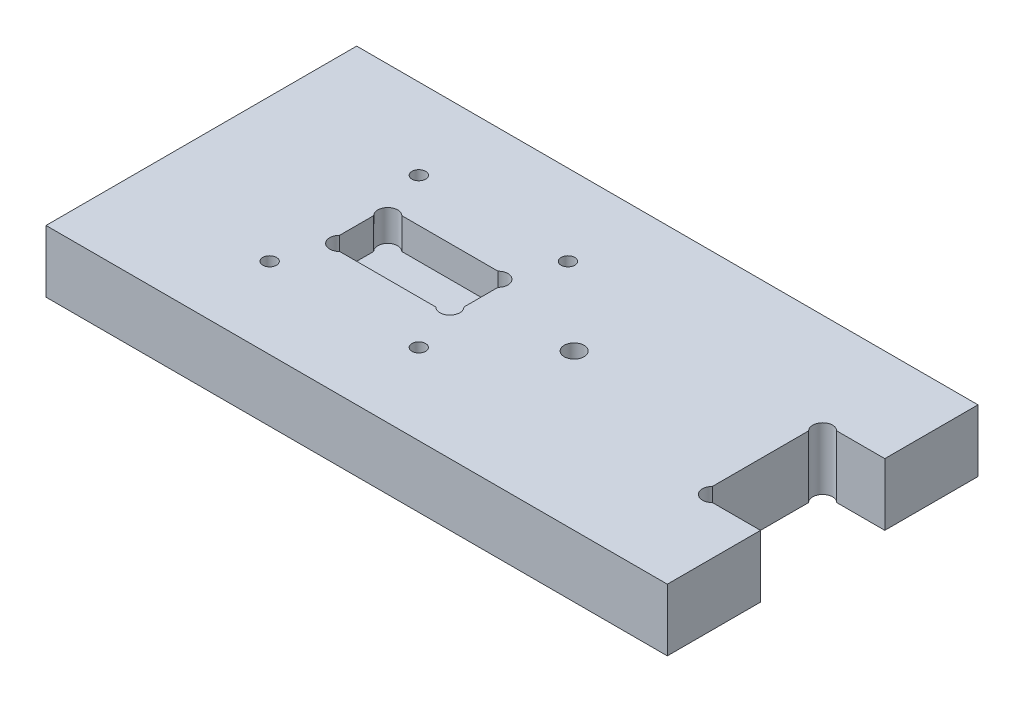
ISO-10303-21;
HEADER;
FILE_DESCRIPTION(('STEP AP214'),'2;1');
FILE_NAME('part.step','',(''),(''),'','','');
FILE_SCHEMA(('AUTOMOTIVE_DESIGN { 1 0 10303 214 1 1 1 1 }'));
ENDSEC;
DATA;
#1=APPLICATION_CONTEXT('core data for automotive mechanical design processes');
#2=APPLICATION_PROTOCOL_DEFINITION('international standard','automotive_design',2000,#1);
#3=PRODUCT_CONTEXT('',#1,'mechanical');
#4=PRODUCT('Part','Part','',(#3));
#5=PRODUCT_RELATED_PRODUCT_CATEGORY('part','',(#4));
#6=PRODUCT_DEFINITION_FORMATION('','',#4);
#7=PRODUCT_DEFINITION_CONTEXT('part definition',#1,'design');
#8=PRODUCT_DEFINITION('design','',#6,#7);
#9=PRODUCT_DEFINITION_SHAPE('','',#8);
#10=(LENGTH_UNIT() NAMED_UNIT(*) SI_UNIT(.MILLI.,.METRE.));
#11=(NAMED_UNIT(*) PLANE_ANGLE_UNIT() SI_UNIT($,.RADIAN.));
#12=(NAMED_UNIT(*) SI_UNIT($,.STERADIAN.) SOLID_ANGLE_UNIT());
#13=UNCERTAINTY_MEASURE_WITH_UNIT(LENGTH_MEASURE(1.E-05),#10,'distance_accuracy_value','');
#14=(GEOMETRIC_REPRESENTATION_CONTEXT(3) GLOBAL_UNCERTAINTY_ASSIGNED_CONTEXT((#13)) GLOBAL_UNIT_ASSIGNED_CONTEXT((#10,
#11,#12)) REPRESENTATION_CONTEXT('',''));
#15=CARTESIAN_POINT('',(0.,0.,0.));
#16=DIRECTION('',(0.,0.,1.));
#17=DIRECTION('',(1.,0.,0.));
#18=AXIS2_PLACEMENT_3D('',#15,#16,#17);
#19=CARTESIAN_POINT('',(91.1313708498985,10.,-33.8686291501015));
#20=DIRECTION('',(0.,-1.,0.));
#21=DIRECTION('',(0.,0.,-1.));
#22=AXIS2_PLACEMENT_3D('',#19,#20,#21);
#23=PLANE('',#22);
#24=DIRECTION('',(0.,0.,1.));
#25=VECTOR('',#24,1.);
#26=CARTESIAN_POINT('',(25.,10.,-27.737258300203));
#27=LINE('',#26,#25);
#28=CARTESIAN_POINT('',(25.,10.,-27.737258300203));
#29=VERTEX_POINT('',#28);
#30=CARTESIAN_POINT('',(25.,10.,-22.262741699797));
#31=VERTEX_POINT('',#30);
#32=EDGE_CURVE('E292',#29,#31,#27,.T.);
#33=ORIENTED_EDGE('',*,*,#32,.F.);
#34=CARTESIAN_POINT('',(26.1313708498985,10.,-28.8686291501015));
#35=DIRECTION('',(0.,1.,0.));
#36=DIRECTION('',(0.,0.,1.));
#37=AXIS2_PLACEMENT_3D('',#34,#35,#36);
#38=CIRCLE('',#37,1.6);
#39=CARTESIAN_POINT('',(27.262741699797,10.,-30.));
#40=VERTEX_POINT('',#39);
#41=EDGE_CURVE('E47',#40,#29,#38,.T.);
#42=ORIENTED_EDGE('',*,*,#41,.F.);
#43=DIRECTION('',(-1.,0.,0.));
#44=VECTOR('',#43,1.);
#45=CARTESIAN_POINT('',(27.262741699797,10.,-30.));
#46=LINE('',#45,#44);
#47=CARTESIAN_POINT('',(42.7372583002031,10.,-30.));
#48=VERTEX_POINT('',#47);
#49=EDGE_CURVE('E273',#48,#40,#46,.T.);
#50=ORIENTED_EDGE('',*,*,#49,.F.);
#51=CARTESIAN_POINT('',(43.8686291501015,10.,-28.8686291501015));
#52=DIRECTION('',(0.,1.,0.));
#53=DIRECTION('',(0.,0.,-1.));
#54=AXIS2_PLACEMENT_3D('',#51,#52,#53);
#55=CIRCLE('',#54,1.6);
#56=CARTESIAN_POINT('',(45.,10.,-27.737258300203));
#57=VERTEX_POINT('',#56);
#58=EDGE_CURVE('E277',#57,#48,#55,.T.);
#59=ORIENTED_EDGE('',*,*,#58,.F.);
#60=DIRECTION('',(0.,0.,-1.));
#61=VECTOR('',#60,1.);
#62=CARTESIAN_POINT('',(45.,10.,-27.737258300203));
#63=LINE('',#62,#61);
#64=CARTESIAN_POINT('',(45.,10.,-22.262741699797));
#65=VERTEX_POINT('',#64);
#66=EDGE_CURVE('E280',#65,#57,#63,.T.);
#67=ORIENTED_EDGE('',*,*,#66,.F.);
#68=CARTESIAN_POINT('',(43.8686291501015,10.,-21.1313708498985));
#69=DIRECTION('',(0.,1.,0.));
#70=DIRECTION('',(0.,0.,1.));
#71=AXIS2_PLACEMENT_3D('',#68,#69,#70);
#72=CIRCLE('',#71,1.6);
#73=CARTESIAN_POINT('',(42.7372583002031,10.,-20.));
#74=VERTEX_POINT('',#73);
#75=EDGE_CURVE('E283',#74,#65,#72,.T.);
#76=ORIENTED_EDGE('',*,*,#75,.F.);
#77=DIRECTION('',(1.,0.,0.));
#78=VECTOR('',#77,1.);
#79=CARTESIAN_POINT('',(27.262741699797,10.,-20.));
#80=LINE('',#79,#78);
#81=CARTESIAN_POINT('',(27.262741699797,10.,-20.));
#82=VERTEX_POINT('',#81);
#83=EDGE_CURVE('E286',#82,#74,#80,.T.);
#84=ORIENTED_EDGE('',*,*,#83,.F.);
#85=CARTESIAN_POINT('',(26.1313708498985,10.,-21.1313708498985));
#86=DIRECTION('',(0.,1.,0.));
#87=DIRECTION('',(0.,0.,-1.));
#88=AXIS2_PLACEMENT_3D('',#85,#86,#87);
#89=CIRCLE('',#88,1.6);
#90=EDGE_CURVE('E289',#31,#82,#89,.T.);
#91=ORIENTED_EDGE('',*,*,#90,.F.);
#92=EDGE_LOOP('',(#33,#42,#50,#59,#67,#76,#84,#91));
#93=FACE_BOUND('',#92,.T.);
#94=CARTESIAN_POINT('',(23.,10.,-37.));
#95=DIRECTION('',(0.,1.,0.));
#96=DIRECTION('',(0.,0.,-1.));
#97=AXIS2_PLACEMENT_3D('',#94,#95,#96);
#98=CIRCLE('',#97,1.1);
#99=CARTESIAN_POINT('',(23.,10.,-38.1));
#100=VERTEX_POINT('',#99);
#101=EDGE_CURVE('E236',#100,#100,#98,.T.);
#102=ORIENTED_EDGE('',*,*,#101,.F.);
#103=EDGE_LOOP('',(#102));
#104=FACE_BOUND('',#103,.T.);
#105=CARTESIAN_POINT('',(47.,10.,-13.));
#106=DIRECTION('',(0.,1.,0.));
#107=DIRECTION('',(0.,0.,-1.));
#108=AXIS2_PLACEMENT_3D('',#105,#106,#107);
#109=CIRCLE('',#108,1.1);
#110=CARTESIAN_POINT('',(47.,10.,-14.1));
#111=VERTEX_POINT('',#110);
#112=EDGE_CURVE('E224',#111,#111,#109,.T.);
#113=ORIENTED_EDGE('',*,*,#112,.F.);
#114=EDGE_LOOP('',(#113));
#115=FACE_BOUND('',#114,.T.);
#116=DIRECTION('',(-1.,0.,0.));
#117=VECTOR('',#116,1.);
#118=CARTESIAN_POINT('',(0.,10.,-50.));
#119=LINE('',#118,#117);
#120=CARTESIAN_POINT('',(100.,10.,-50.));
#121=VERTEX_POINT('',#120);
#122=CARTESIAN_POINT('',(0.,10.,-50.));
#123=VERTEX_POINT('',#122);
#124=EDGE_CURVE('E173',#121,#123,#119,.T.);
#125=ORIENTED_EDGE('',*,*,#124,.T.);
#126=DIRECTION('',(0.,0.,1.));
#127=VECTOR('',#126,1.);
#128=CARTESIAN_POINT('',(0.,10.,-50.));
#129=LINE('',#128,#127);
#130=CARTESIAN_POINT('',(0.,10.,0.));
#131=VERTEX_POINT('',#130);
#132=EDGE_CURVE('E103',#123,#131,#129,.T.);
#133=ORIENTED_EDGE('',*,*,#132,.T.);
#134=DIRECTION('',(1.,0.,0.));
#135=VECTOR('',#134,1.);
#136=CARTESIAN_POINT('',(0.,10.,0.));
#137=LINE('',#136,#135);
#138=CARTESIAN_POINT('',(100.,10.,0.));
#139=VERTEX_POINT('',#138);
#140=EDGE_CURVE('E194',#131,#139,#137,.T.);
#141=ORIENTED_EDGE('',*,*,#140,.T.);
#142=DIRECTION('',(0.,0.,-1.));
#143=VECTOR('',#142,1.);
#144=CARTESIAN_POINT('',(100.,10.,-15.));
#145=LINE('',#144,#143);
#146=CARTESIAN_POINT('',(100.,10.,-15.));
#147=VERTEX_POINT('',#146);
#148=EDGE_CURVE('E213',#139,#147,#145,.T.);
#149=ORIENTED_EDGE('',*,*,#148,.T.);
#150=DIRECTION('',(-1.,0.,0.));
#151=VECTOR('',#150,1.);
#152=CARTESIAN_POINT('',(92.262741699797,10.,-15.));
#153=LINE('',#152,#151);
#154=CARTESIAN_POINT('',(92.262741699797,10.,-15.));
#155=VERTEX_POINT('',#154);
#156=EDGE_CURVE('E210',#147,#155,#153,.T.);
#157=ORIENTED_EDGE('',*,*,#156,.T.);
#158=CARTESIAN_POINT('',(91.1313708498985,10.,-16.1313708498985));
#159=DIRECTION('',(0.,-1.,0.));
#160=DIRECTION('',(0.,0.,1.));
#161=AXIS2_PLACEMENT_3D('',#158,#159,#160);
#162=CIRCLE('',#161,1.60000000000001);
#163=CARTESIAN_POINT('',(90.,10.,-17.2627416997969));
#164=VERTEX_POINT('',#163);
#165=EDGE_CURVE('E212',#155,#164,#162,.T.);
#166=ORIENTED_EDGE('',*,*,#165,.T.);
#167=DIRECTION('',(0.,0.,-1.));
#168=VECTOR('',#167,1.);
#169=CARTESIAN_POINT('',(90.,10.,-32.7372583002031));
#170=LINE('',#169,#168);
#171=CARTESIAN_POINT('',(90.,10.,-32.7372583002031));
#172=VERTEX_POINT('',#171);
#173=EDGE_CURVE('E132',#164,#172,#170,.T.);
#174=ORIENTED_EDGE('',*,*,#173,.T.);
#175=CARTESIAN_POINT('',(91.1313708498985,10.,-33.8686291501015));
#176=DIRECTION('',(0.,-1.,0.));
#177=DIRECTION('',(0.,0.,-1.));
#178=AXIS2_PLACEMENT_3D('',#175,#176,#177);
#179=CIRCLE('',#178,1.60000000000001);
#180=CARTESIAN_POINT('',(92.262741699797,10.,-35.));
#181=VERTEX_POINT('',#180);
#182=EDGE_CURVE('E125',#172,#181,#179,.T.);
#183=ORIENTED_EDGE('',*,*,#182,.T.);
#184=DIRECTION('',(1.,0.,0.));
#185=VECTOR('',#184,1.);
#186=CARTESIAN_POINT('',(92.262741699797,10.,-35.));
#187=LINE('',#186,#185);
#188=CARTESIAN_POINT('',(100.,10.,-35.));
#189=VERTEX_POINT('',#188);
#190=EDGE_CURVE('E129',#181,#189,#187,.T.);
#191=ORIENTED_EDGE('',*,*,#190,.T.);
#192=DIRECTION('',(0.,0.,-1.));
#193=VECTOR('',#192,1.);
#194=CARTESIAN_POINT('',(100.,10.,-35.));
#195=LINE('',#194,#193);
#196=EDGE_CURVE('E56',#189,#121,#195,.T.);
#197=ORIENTED_EDGE('',*,*,#196,.T.);
#198=EDGE_LOOP('',(#125,#133,#141,#149,#157,#166,#174,#183,#191,#197));
#199=FACE_BOUND('',#198,.T.);
#200=CARTESIAN_POINT('',(23.,10.,-13.));
#201=DIRECTION('',(0.,1.,0.));
#202=DIRECTION('',(0.,0.,1.));
#203=AXIS2_PLACEMENT_3D('',#200,#201,#202);
#204=CIRCLE('',#203,1.1);
#205=CARTESIAN_POINT('',(23.,10.,-11.9));
#206=VERTEX_POINT('',#205);
#207=EDGE_CURVE('E157',#206,#206,#204,.T.);
#208=ORIENTED_EDGE('',*,*,#207,.F.);
#209=EDGE_LOOP('',(#208));
#210=FACE_BOUND('',#209,.T.);
#211=CARTESIAN_POINT('',(47.,10.,-37.));
#212=DIRECTION('',(0.,1.,0.));
#213=DIRECTION('',(0.,0.,1.));
#214=AXIS2_PLACEMENT_3D('',#211,#212,#213);
#215=CIRCLE('',#214,1.1);
#216=CARTESIAN_POINT('',(47.,10.,-35.9));
#217=VERTEX_POINT('',#216);
#218=EDGE_CURVE('E230',#217,#217,#215,.T.);
#219=ORIENTED_EDGE('',*,*,#218,.F.);
#220=EDGE_LOOP('',(#219));
#221=FACE_BOUND('',#220,.T.);
#222=CARTESIAN_POINT('',(60.0000000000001,10.,-25.));
#223=DIRECTION('',(0.,1.,0.));
#224=DIRECTION('',(0.,0.,1.));
#225=AXIS2_PLACEMENT_3D('',#222,#223,#224);
#226=CIRCLE('',#225,1.6);
#227=CARTESIAN_POINT('',(60.0000000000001,10.,-23.4));
#228=VERTEX_POINT('',#227);
#229=EDGE_CURVE('E242',#228,#228,#226,.T.);
#230=ORIENTED_EDGE('',*,*,#229,.F.);
#231=EDGE_LOOP('',(#230));
#232=FACE_BOUND('',#231,.T.);
#233=ADVANCED_FACE('F32',(#93,#104,#115,#199,#210,#221,#232),#23,.F.);
#234=CARTESIAN_POINT('',(91.1313708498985,0.,-33.8686291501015));
#235=DIRECTION('',(0.,-1.,0.));
#236=DIRECTION('',(0.,0.,-1.));
#237=AXIS2_PLACEMENT_3D('',#234,#235,#236);
#238=PLANE('',#237);
#239=CARTESIAN_POINT('',(23.,0.,-37.));
#240=DIRECTION('',(0.,1.,0.));
#241=DIRECTION('',(0.,0.,-1.));
#242=AXIS2_PLACEMENT_3D('',#239,#240,#241);
#243=CIRCLE('',#242,1.1);
#244=CARTESIAN_POINT('',(23.,0.,-38.1));
#245=VERTEX_POINT('',#244);
#246=EDGE_CURVE('E239',#245,#245,#243,.T.);
#247=ORIENTED_EDGE('',*,*,#246,.T.);
#248=EDGE_LOOP('',(#247));
#249=FACE_BOUND('',#248,.T.);
#250=CARTESIAN_POINT('',(47.,0.,-13.));
#251=DIRECTION('',(0.,1.,0.));
#252=DIRECTION('',(0.,0.,-1.));
#253=AXIS2_PLACEMENT_3D('',#250,#251,#252);
#254=CIRCLE('',#253,1.1);
#255=CARTESIAN_POINT('',(47.,0.,-14.1));
#256=VERTEX_POINT('',#255);
#257=EDGE_CURVE('E227',#256,#256,#254,.T.);
#258=ORIENTED_EDGE('',*,*,#257,.T.);
#259=EDGE_LOOP('',(#258));
#260=FACE_BOUND('',#259,.T.);
#261=DIRECTION('',(-1.,0.,0.));
#262=VECTOR('',#261,1.);
#263=CARTESIAN_POINT('',(0.,0.,-50.));
#264=LINE('',#263,#262);
#265=CARTESIAN_POINT('',(100.,0.,-50.));
#266=VERTEX_POINT('',#265);
#267=CARTESIAN_POINT('',(0.,0.,-50.));
#268=VERTEX_POINT('',#267);
#269=EDGE_CURVE('E153',#266,#268,#264,.T.);
#270=ORIENTED_EDGE('',*,*,#269,.F.);
#271=DIRECTION('',(0.,0.,-1.));
#272=VECTOR('',#271,1.);
#273=CARTESIAN_POINT('',(100.,0.,-35.));
#274=LINE('',#273,#272);
#275=CARTESIAN_POINT('',(100.,0.,-35.));
#276=VERTEX_POINT('',#275);
#277=EDGE_CURVE('E95',#276,#266,#274,.T.);
#278=ORIENTED_EDGE('',*,*,#277,.F.);
#279=DIRECTION('',(1.,0.,0.));
#280=VECTOR('',#279,1.);
#281=CARTESIAN_POINT('',(92.262741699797,0.,-35.));
#282=LINE('',#281,#280);
#283=CARTESIAN_POINT('',(92.262741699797,0.,-35.));
#284=VERTEX_POINT('',#283);
#285=EDGE_CURVE('E170',#284,#276,#282,.T.);
#286=ORIENTED_EDGE('',*,*,#285,.F.);
#287=CARTESIAN_POINT('',(91.1313708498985,0.,-33.8686291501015));
#288=DIRECTION('',(0.,-1.,0.));
#289=DIRECTION('',(0.,0.,-1.));
#290=AXIS2_PLACEMENT_3D('',#287,#288,#289);
#291=CIRCLE('',#290,1.60000000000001);
#292=CARTESIAN_POINT('',(90.,0.,-32.7372583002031));
#293=VERTEX_POINT('',#292);
#294=EDGE_CURVE('E141',#293,#284,#291,.T.);
#295=ORIENTED_EDGE('',*,*,#294,.F.);
#296=DIRECTION('',(0.,0.,-1.));
#297=VECTOR('',#296,1.);
#298=CARTESIAN_POINT('',(90.,0.,-32.7372583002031));
#299=LINE('',#298,#297);
#300=CARTESIAN_POINT('',(90.,0.,-17.2627416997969));
#301=VERTEX_POINT('',#300);
#302=EDGE_CURVE('E167',#301,#293,#299,.T.);
#303=ORIENTED_EDGE('',*,*,#302,.F.);
#304=CARTESIAN_POINT('',(91.1313708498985,0.,-16.1313708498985));
#305=DIRECTION('',(0.,-1.,0.));
#306=DIRECTION('',(0.,0.,1.));
#307=AXIS2_PLACEMENT_3D('',#304,#305,#306);
#308=CIRCLE('',#307,1.60000000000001);
#309=CARTESIAN_POINT('',(92.262741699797,0.,-15.));
#310=VERTEX_POINT('',#309);
#311=EDGE_CURVE('E165',#310,#301,#308,.T.);
#312=ORIENTED_EDGE('',*,*,#311,.F.);
#313=DIRECTION('',(-1.,0.,0.));
#314=VECTOR('',#313,1.);
#315=CARTESIAN_POINT('',(92.262741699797,0.,-15.));
#316=LINE('',#315,#314);
#317=CARTESIAN_POINT('',(100.,0.,-15.));
#318=VERTEX_POINT('',#317);
#319=EDGE_CURVE('E163',#318,#310,#316,.T.);
#320=ORIENTED_EDGE('',*,*,#319,.F.);
#321=DIRECTION('',(0.,0.,-1.));
#322=VECTOR('',#321,1.);
#323=CARTESIAN_POINT('',(100.,0.,-15.));
#324=LINE('',#323,#322);
#325=CARTESIAN_POINT('',(100.,0.,0.));
#326=VERTEX_POINT('',#325);
#327=EDGE_CURVE('E161',#326,#318,#324,.T.);
#328=ORIENTED_EDGE('',*,*,#327,.F.);
#329=DIRECTION('',(1.,0.,0.));
#330=VECTOR('',#329,1.);
#331=CARTESIAN_POINT('',(0.,0.,0.));
#332=LINE('',#331,#330);
#333=CARTESIAN_POINT('',(0.,0.,0.));
#334=VERTEX_POINT('',#333);
#335=EDGE_CURVE('E159',#334,#326,#332,.T.);
#336=ORIENTED_EDGE('',*,*,#335,.F.);
#337=DIRECTION('',(0.,0.,1.));
#338=VECTOR('',#337,1.);
#339=CARTESIAN_POINT('',(0.,0.,-50.));
#340=LINE('',#339,#338);
#341=EDGE_CURVE('E156',#268,#334,#340,.T.);
#342=ORIENTED_EDGE('',*,*,#341,.F.);
#343=EDGE_LOOP('',(#270,#278,#286,#295,#303,#312,#320,#328,#336,#342));
#344=FACE_BOUND('',#343,.T.);
#345=CARTESIAN_POINT('',(23.,0.,-13.));
#346=DIRECTION('',(0.,1.,0.));
#347=DIRECTION('',(0.,0.,1.));
#348=AXIS2_PLACEMENT_3D('',#345,#346,#347);
#349=CIRCLE('',#348,1.1);
#350=CARTESIAN_POINT('',(23.,0.,-11.9));
#351=VERTEX_POINT('',#350);
#352=EDGE_CURVE('E221',#351,#351,#349,.T.);
#353=ORIENTED_EDGE('',*,*,#352,.T.);
#354=EDGE_LOOP('',(#353));
#355=FACE_BOUND('',#354,.T.);
#356=CARTESIAN_POINT('',(47.,0.,-37.));
#357=DIRECTION('',(0.,1.,0.));
#358=DIRECTION('',(0.,0.,1.));
#359=AXIS2_PLACEMENT_3D('',#356,#357,#358);
#360=CIRCLE('',#359,1.1);
#361=CARTESIAN_POINT('',(47.,0.,-35.9));
#362=VERTEX_POINT('',#361);
#363=EDGE_CURVE('E233',#362,#362,#360,.T.);
#364=ORIENTED_EDGE('',*,*,#363,.T.);
#365=EDGE_LOOP('',(#364));
#366=FACE_BOUND('',#365,.T.);
#367=CARTESIAN_POINT('',(60.0000000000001,0.,-25.));
#368=DIRECTION('',(0.,1.,0.));
#369=DIRECTION('',(0.,0.,1.));
#370=AXIS2_PLACEMENT_3D('',#367,#368,#369);
#371=CIRCLE('',#370,1.6);
#372=CARTESIAN_POINT('',(60.0000000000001,0.,-23.4));
#373=VERTEX_POINT('',#372);
#374=EDGE_CURVE('E245',#373,#373,#371,.T.);
#375=ORIENTED_EDGE('',*,*,#374,.T.);
#376=EDGE_LOOP('',(#375));
#377=FACE_BOUND('',#376,.T.);
#378=ADVANCED_FACE('F198',(#249,#260,#344,#355,#366,#377),#238,.T.);
#379=CARTESIAN_POINT('',(0.,10.,-50.));
#380=DIRECTION('',(0.,0.,1.));
#381=DIRECTION('',(1.,0.,0.));
#382=AXIS2_PLACEMENT_3D('',#379,#380,#381);
#383=PLANE('',#382);
#384=ORIENTED_EDGE('',*,*,#269,.T.);
#385=DIRECTION('',(0.,-1.,0.));
#386=VECTOR('',#385,1.);
#387=CARTESIAN_POINT('',(0.,10.,-50.));
#388=LINE('',#387,#386);
#389=EDGE_CURVE('E11',#123,#268,#388,.T.);
#390=ORIENTED_EDGE('',*,*,#389,.F.);
#391=ORIENTED_EDGE('',*,*,#124,.F.);
#392=DIRECTION('',(0.,-1.,0.));
#393=VECTOR('',#392,1.);
#394=CARTESIAN_POINT('',(100.,10.,-50.));
#395=LINE('',#394,#393);
#396=EDGE_CURVE('E149',#121,#266,#395,.T.);
#397=ORIENTED_EDGE('',*,*,#396,.T.);
#398=EDGE_LOOP('',(#384,#390,#391,#397));
#399=FACE_BOUND('',#398,.T.);
#400=ADVANCED_FACE('F34',(#399),#383,.F.);
#401=CARTESIAN_POINT('',(0.,10.,-50.));
#402=DIRECTION('',(1.,0.,0.));
#403=DIRECTION('',(0.,0.,-1.));
#404=AXIS2_PLACEMENT_3D('',#401,#402,#403);
#405=PLANE('',#404);
#406=ORIENTED_EDGE('',*,*,#341,.T.);
#407=DIRECTION('',(0.,-1.,0.));
#408=VECTOR('',#407,1.);
#409=CARTESIAN_POINT('',(0.,10.,0.));
#410=LINE('',#409,#408);
#411=EDGE_CURVE('E40',#131,#334,#410,.T.);
#412=ORIENTED_EDGE('',*,*,#411,.F.);
#413=ORIENTED_EDGE('',*,*,#132,.F.);
#414=ORIENTED_EDGE('',*,*,#389,.T.);
#415=EDGE_LOOP('',(#406,#412,#413,#414));
#416=FACE_BOUND('',#415,.T.);
#417=ADVANCED_FACE('F423',(#416),#405,.F.);
#418=CARTESIAN_POINT('',(0.,10.,0.));
#419=DIRECTION('',(0.,0.,-1.));
#420=DIRECTION('',(-1.,0.,0.));
#421=AXIS2_PLACEMENT_3D('',#418,#419,#420);
#422=PLANE('',#421);
#423=ORIENTED_EDGE('',*,*,#335,.T.);
#424=DIRECTION('',(0.,-1.,0.));
#425=VECTOR('',#424,1.);
#426=CARTESIAN_POINT('',(100.,10.,0.));
#427=LINE('',#426,#425);
#428=EDGE_CURVE('E186',#139,#326,#427,.T.);
#429=ORIENTED_EDGE('',*,*,#428,.F.);
#430=ORIENTED_EDGE('',*,*,#140,.F.);
#431=ORIENTED_EDGE('',*,*,#411,.T.);
#432=EDGE_LOOP('',(#423,#429,#430,#431));
#433=FACE_BOUND('',#432,.T.);
#434=ADVANCED_FACE('F192',(#433),#422,.F.);
#435=CARTESIAN_POINT('',(100.,10.,-15.));
#436=DIRECTION('',(-1.,0.,0.));
#437=DIRECTION('',(0.,0.,1.));
#438=AXIS2_PLACEMENT_3D('',#435,#436,#437);
#439=PLANE('',#438);
#440=ORIENTED_EDGE('',*,*,#327,.T.);
#441=DIRECTION('',(0.,-1.,0.));
#442=VECTOR('',#441,1.);
#443=CARTESIAN_POINT('',(100.,10.,-15.));
#444=LINE('',#443,#442);
#445=EDGE_CURVE('E183',#147,#318,#444,.T.);
#446=ORIENTED_EDGE('',*,*,#445,.F.);
#447=ORIENTED_EDGE('',*,*,#148,.F.);
#448=ORIENTED_EDGE('',*,*,#428,.T.);
#449=EDGE_LOOP('',(#440,#446,#447,#448));
#450=FACE_BOUND('',#449,.T.);
#451=ADVANCED_FACE('F204',(#450),#439,.F.);
#452=CARTESIAN_POINT('',(92.262741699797,10.,-15.));
#453=DIRECTION('',(0.,0.,1.));
#454=DIRECTION('',(1.,0.,0.));
#455=AXIS2_PLACEMENT_3D('',#452,#453,#454);
#456=PLANE('',#455);
#457=ORIENTED_EDGE('',*,*,#319,.T.);
#458=DIRECTION('',(0.,-1.,0.));
#459=VECTOR('',#458,1.);
#460=CARTESIAN_POINT('',(92.262741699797,10.,-15.));
#461=LINE('',#460,#459);
#462=EDGE_CURVE('E180',#155,#310,#461,.T.);
#463=ORIENTED_EDGE('',*,*,#462,.F.);
#464=ORIENTED_EDGE('',*,*,#156,.F.);
#465=ORIENTED_EDGE('',*,*,#445,.T.);
#466=EDGE_LOOP('',(#457,#463,#464,#465));
#467=FACE_BOUND('',#466,.T.);
#468=ADVANCED_FACE('F208',(#467),#456,.F.);
#469=CARTESIAN_POINT('',(91.1313708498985,10.,-16.1313708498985));
#470=DIRECTION('',(0.,-1.,0.));
#471=DIRECTION('',(0.,0.,-1.));
#472=AXIS2_PLACEMENT_3D('',#469,#470,#471);
#473=CYLINDRICAL_SURFACE('',#472,1.60000000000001);
#474=ORIENTED_EDGE('',*,*,#311,.T.);
#475=DIRECTION('',(0.,-1.,0.));
#476=VECTOR('',#475,1.);
#477=CARTESIAN_POINT('',(90.,10.,-17.2627416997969));
#478=LINE('',#477,#476);
#479=EDGE_CURVE('E177',#164,#301,#478,.T.);
#480=ORIENTED_EDGE('',*,*,#479,.F.);
#481=ORIENTED_EDGE('',*,*,#165,.F.);
#482=ORIENTED_EDGE('',*,*,#462,.T.);
#483=EDGE_LOOP('',(#474,#480,#481,#482));
#484=FACE_BOUND('',#483,.T.);
#485=ADVANCED_FACE('F413',(#484),#473,.F.);
#486=CARTESIAN_POINT('',(90.,10.,-32.7372583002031));
#487=DIRECTION('',(-1.,0.,0.));
#488=DIRECTION('',(0.,0.,1.));
#489=AXIS2_PLACEMENT_3D('',#486,#487,#488);
#490=PLANE('',#489);
#491=ORIENTED_EDGE('',*,*,#302,.T.);
#492=DIRECTION('',(0.,-1.,0.));
#493=VECTOR('',#492,1.);
#494=CARTESIAN_POINT('',(90.,10.,-32.7372583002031));
#495=LINE('',#494,#493);
#496=EDGE_CURVE('E144',#172,#293,#495,.T.);
#497=ORIENTED_EDGE('',*,*,#496,.F.);
#498=ORIENTED_EDGE('',*,*,#173,.F.);
#499=ORIENTED_EDGE('',*,*,#479,.T.);
#500=EDGE_LOOP('',(#491,#497,#498,#499));
#501=FACE_BOUND('',#500,.T.);
#502=ADVANCED_FACE('F410',(#501),#490,.F.);
#503=CARTESIAN_POINT('',(91.1313708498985,10.,-33.8686291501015));
#504=DIRECTION('',(0.,-1.,0.));
#505=DIRECTION('',(0.,0.,-1.));
#506=AXIS2_PLACEMENT_3D('',#503,#504,#505);
#507=CYLINDRICAL_SURFACE('',#506,1.60000000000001);
#508=ORIENTED_EDGE('',*,*,#294,.T.);
#509=DIRECTION('',(0.,-1.,0.));
#510=VECTOR('',#509,1.);
#511=CARTESIAN_POINT('',(92.262741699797,10.,-35.));
#512=LINE('',#511,#510);
#513=EDGE_CURVE('E138',#181,#284,#512,.T.);
#514=ORIENTED_EDGE('',*,*,#513,.F.);
#515=ORIENTED_EDGE('',*,*,#182,.F.);
#516=ORIENTED_EDGE('',*,*,#496,.T.);
#517=EDGE_LOOP('',(#508,#514,#515,#516));
#518=FACE_BOUND('',#517,.T.);
#519=ADVANCED_FACE('F139',(#518),#507,.F.);
#520=CARTESIAN_POINT('',(92.262741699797,10.,-35.));
#521=DIRECTION('',(0.,0.,-1.));
#522=DIRECTION('',(-1.,0.,0.));
#523=AXIS2_PLACEMENT_3D('',#520,#521,#522);
#524=PLANE('',#523);
#525=ORIENTED_EDGE('',*,*,#285,.T.);
#526=DIRECTION('',(0.,-1.,0.));
#527=VECTOR('',#526,1.);
#528=CARTESIAN_POINT('',(100.,10.,-35.));
#529=LINE('',#528,#527);
#530=EDGE_CURVE('E145',#189,#276,#529,.T.);
#531=ORIENTED_EDGE('',*,*,#530,.F.);
#532=ORIENTED_EDGE('',*,*,#190,.F.);
#533=ORIENTED_EDGE('',*,*,#513,.T.);
#534=EDGE_LOOP('',(#525,#531,#532,#533));
#535=FACE_BOUND('',#534,.T.);
#536=ADVANCED_FACE('F147',(#535),#524,.F.);
#537=CARTESIAN_POINT('',(100.,10.,-35.));
#538=DIRECTION('',(-1.,0.,0.));
#539=DIRECTION('',(0.,0.,1.));
#540=AXIS2_PLACEMENT_3D('',#537,#538,#539);
#541=PLANE('',#540);
#542=ORIENTED_EDGE('',*,*,#277,.T.);
#543=ORIENTED_EDGE('',*,*,#396,.F.);
#544=ORIENTED_EDGE('',*,*,#196,.F.);
#545=ORIENTED_EDGE('',*,*,#530,.T.);
#546=EDGE_LOOP('',(#542,#543,#544,#545));
#547=FACE_BOUND('',#546,.T.);
#548=ADVANCED_FACE('F403',(#547),#541,.F.);
#549=CARTESIAN_POINT('',(23.,10.,-13.));
#550=DIRECTION('',(0.,-1.,0.));
#551=DIRECTION('',(0.,0.,-1.));
#552=AXIS2_PLACEMENT_3D('',#549,#550,#551);
#553=CYLINDRICAL_SURFACE('',#552,1.1);
#554=ORIENTED_EDGE('',*,*,#207,.T.);
#555=EDGE_LOOP('',(#554));
#556=FACE_BOUND('',#555,.T.);
#557=ORIENTED_EDGE('',*,*,#352,.F.);
#558=EDGE_LOOP('',(#557));
#559=FACE_BOUND('',#558,.T.);
#560=ADVANCED_FACE('F400',(#556,#559),#553,.F.);
#561=CARTESIAN_POINT('',(47.,10.,-13.));
#562=DIRECTION('',(0.,-1.,0.));
#563=DIRECTION('',(0.,0.,-1.));
#564=AXIS2_PLACEMENT_3D('',#561,#562,#563);
#565=CYLINDRICAL_SURFACE('',#564,1.1);
#566=ORIENTED_EDGE('',*,*,#112,.T.);
#567=EDGE_LOOP('',(#566));
#568=FACE_BOUND('',#567,.T.);
#569=ORIENTED_EDGE('',*,*,#257,.F.);
#570=EDGE_LOOP('',(#569));
#571=FACE_BOUND('',#570,.T.);
#572=ADVANCED_FACE('F498',(#568,#571),#565,.F.);
#573=CARTESIAN_POINT('',(47.,10.,-37.));
#574=DIRECTION('',(0.,-1.,0.));
#575=DIRECTION('',(0.,0.,-1.));
#576=AXIS2_PLACEMENT_3D('',#573,#574,#575);
#577=CYLINDRICAL_SURFACE('',#576,1.1);
#578=ORIENTED_EDGE('',*,*,#218,.T.);
#579=EDGE_LOOP('',(#578));
#580=FACE_BOUND('',#579,.T.);
#581=ORIENTED_EDGE('',*,*,#363,.F.);
#582=EDGE_LOOP('',(#581));
#583=FACE_BOUND('',#582,.T.);
#584=ADVANCED_FACE('F506',(#580,#583),#577,.F.);
#585=CARTESIAN_POINT('',(23.,10.,-37.));
#586=DIRECTION('',(0.,-1.,0.));
#587=DIRECTION('',(0.,0.,-1.));
#588=AXIS2_PLACEMENT_3D('',#585,#586,#587);
#589=CYLINDRICAL_SURFACE('',#588,1.1);
#590=ORIENTED_EDGE('',*,*,#101,.T.);
#591=EDGE_LOOP('',(#590));
#592=FACE_BOUND('',#591,.T.);
#593=ORIENTED_EDGE('',*,*,#246,.F.);
#594=EDGE_LOOP('',(#593));
#595=FACE_BOUND('',#594,.T.);
#596=ADVANCED_FACE('F514',(#592,#595),#589,.F.);
#597=CARTESIAN_POINT('',(60.0000000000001,10.,-25.));
#598=DIRECTION('',(0.,-1.,0.));
#599=DIRECTION('',(0.,0.,-1.));
#600=AXIS2_PLACEMENT_3D('',#597,#598,#599);
#601=CYLINDRICAL_SURFACE('',#600,1.6);
#602=ORIENTED_EDGE('',*,*,#229,.T.);
#603=EDGE_LOOP('',(#602));
#604=FACE_BOUND('',#603,.T.);
#605=ORIENTED_EDGE('',*,*,#374,.F.);
#606=EDGE_LOOP('',(#605));
#607=FACE_BOUND('',#606,.T.);
#608=ADVANCED_FACE('F523',(#604,#607),#601,.F.);
#609=CARTESIAN_POINT('',(26.1313708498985,5.,-28.8686291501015));
#610=DIRECTION('',(0.,1.,0.));
#611=DIRECTION('',(0.,0.,1.));
#612=AXIS2_PLACEMENT_3D('',#609,#610,#611);
#613=CYLINDRICAL_SURFACE('',#612,1.6);
#614=ORIENTED_EDGE('',*,*,#41,.T.);
#615=DIRECTION('',(0.,1.,0.));
#616=VECTOR('',#615,1.);
#617=CARTESIAN_POINT('',(25.,5.,-27.737258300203));
#618=LINE('',#617,#616);
#619=CARTESIAN_POINT('',(25.,5.,-27.737258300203));
#620=VERTEX_POINT('',#619);
#621=EDGE_CURVE('E251',#620,#29,#618,.T.);
#622=ORIENTED_EDGE('',*,*,#621,.F.);
#623=CARTESIAN_POINT('',(26.1313708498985,5.,-28.8686291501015));
#624=DIRECTION('',(0.,1.,0.));
#625=DIRECTION('',(0.,0.,1.));
#626=AXIS2_PLACEMENT_3D('',#623,#624,#625);
#627=CIRCLE('',#626,1.6);
#628=CARTESIAN_POINT('',(27.262741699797,5.,-30.));
#629=VERTEX_POINT('',#628);
#630=EDGE_CURVE('E276',#629,#620,#627,.T.);
#631=ORIENTED_EDGE('',*,*,#630,.F.);
#632=DIRECTION('',(0.,1.,0.));
#633=VECTOR('',#632,1.);
#634=CARTESIAN_POINT('',(27.262741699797,5.,-30.));
#635=LINE('',#634,#633);
#636=EDGE_CURVE('E248',#629,#40,#635,.T.);
#637=ORIENTED_EDGE('',*,*,#636,.T.);
#638=EDGE_LOOP('',(#614,#622,#631,#637));
#639=FACE_BOUND('',#638,.T.);
#640=ADVANCED_FACE('F325',(#639),#613,.F.);
#641=CARTESIAN_POINT('',(27.262741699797,5.,-30.));
#642=DIRECTION('',(0.,0.,-1.));
#643=DIRECTION('',(-1.,0.,0.));
#644=AXIS2_PLACEMENT_3D('',#641,#642,#643);
#645=PLANE('',#644);
#646=ORIENTED_EDGE('',*,*,#49,.T.);
#647=ORIENTED_EDGE('',*,*,#636,.F.);
#648=DIRECTION('',(-1.,0.,0.));
#649=VECTOR('',#648,1.);
#650=CARTESIAN_POINT('',(27.262741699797,5.,-30.));
#651=LINE('',#650,#649);
#652=CARTESIAN_POINT('',(42.7372583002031,5.,-30.));
#653=VERTEX_POINT('',#652);
#654=EDGE_CURVE('E254',#653,#629,#651,.T.);
#655=ORIENTED_EDGE('',*,*,#654,.F.);
#656=DIRECTION('',(0.,1.,0.));
#657=VECTOR('',#656,1.);
#658=CARTESIAN_POINT('',(42.7372583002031,5.,-30.));
#659=LINE('',#658,#657);
#660=EDGE_CURVE('E269',#653,#48,#659,.T.);
#661=ORIENTED_EDGE('',*,*,#660,.T.);
#662=EDGE_LOOP('',(#646,#647,#655,#661));
#663=FACE_BOUND('',#662,.T.);
#664=ADVANCED_FACE('F345',(#663),#645,.F.);
#665=CARTESIAN_POINT('',(43.8686291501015,5.,-28.8686291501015));
#666=DIRECTION('',(0.,1.,0.));
#667=DIRECTION('',(0.,0.,1.));
#668=AXIS2_PLACEMENT_3D('',#665,#666,#667);
#669=CYLINDRICAL_SURFACE('',#668,1.6);
#670=ORIENTED_EDGE('',*,*,#58,.T.);
#671=ORIENTED_EDGE('',*,*,#660,.F.);
#672=CARTESIAN_POINT('',(43.8686291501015,5.,-28.8686291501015));
#673=DIRECTION('',(0.,1.,0.));
#674=DIRECTION('',(0.,0.,-1.));
#675=AXIS2_PLACEMENT_3D('',#672,#673,#674);
#676=CIRCLE('',#675,1.6);
#677=CARTESIAN_POINT('',(45.,5.,-27.737258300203));
#678=VERTEX_POINT('',#677);
#679=EDGE_CURVE('E298',#678,#653,#676,.T.);
#680=ORIENTED_EDGE('',*,*,#679,.F.);
#681=DIRECTION('',(0.,1.,0.));
#682=VECTOR('',#681,1.);
#683=CARTESIAN_POINT('',(45.,5.,-27.737258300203));
#684=LINE('',#683,#682);
#685=EDGE_CURVE('E266',#678,#57,#684,.T.);
#686=ORIENTED_EDGE('',*,*,#685,.T.);
#687=EDGE_LOOP('',(#670,#671,#680,#686));
#688=FACE_BOUND('',#687,.T.);
#689=ADVANCED_FACE('F350',(#688),#669,.F.);
#690=CARTESIAN_POINT('',(45.,5.,-27.737258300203));
#691=DIRECTION('',(1.,0.,0.));
#692=DIRECTION('',(0.,0.,-1.));
#693=AXIS2_PLACEMENT_3D('',#690,#691,#692);
#694=PLANE('',#693);
#695=ORIENTED_EDGE('',*,*,#66,.T.);
#696=ORIENTED_EDGE('',*,*,#685,.F.);
#697=DIRECTION('',(0.,0.,-1.));
#698=VECTOR('',#697,1.);
#699=CARTESIAN_POINT('',(45.,5.,-27.737258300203));
#700=LINE('',#699,#698);
#701=CARTESIAN_POINT('',(45.,5.,-22.262741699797));
#702=VERTEX_POINT('',#701);
#703=EDGE_CURVE('E301',#702,#678,#700,.T.);
#704=ORIENTED_EDGE('',*,*,#703,.F.);
#705=DIRECTION('',(0.,1.,0.));
#706=VECTOR('',#705,1.);
#707=CARTESIAN_POINT('',(45.,5.,-22.262741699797));
#708=LINE('',#707,#706);
#709=EDGE_CURVE('E263',#702,#65,#708,.T.);
#710=ORIENTED_EDGE('',*,*,#709,.T.);
#711=EDGE_LOOP('',(#695,#696,#704,#710));
#712=FACE_BOUND('',#711,.T.);
#713=ADVANCED_FACE('F377',(#712),#694,.F.);
#714=CARTESIAN_POINT('',(43.8686291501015,5.,-21.1313708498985));
#715=DIRECTION('',(0.,1.,0.));
#716=DIRECTION('',(0.,0.,1.));
#717=AXIS2_PLACEMENT_3D('',#714,#715,#716);
#718=CYLINDRICAL_SURFACE('',#717,1.6);
#719=ORIENTED_EDGE('',*,*,#75,.T.);
#720=ORIENTED_EDGE('',*,*,#709,.F.);
#721=CARTESIAN_POINT('',(43.8686291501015,5.,-21.1313708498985));
#722=DIRECTION('',(0.,1.,0.));
#723=DIRECTION('',(0.,0.,1.));
#724=AXIS2_PLACEMENT_3D('',#721,#722,#723);
#725=CIRCLE('',#724,1.6);
#726=CARTESIAN_POINT('',(42.7372583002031,5.,-20.));
#727=VERTEX_POINT('',#726);
#728=EDGE_CURVE('E304',#727,#702,#725,.T.);
#729=ORIENTED_EDGE('',*,*,#728,.F.);
#730=DIRECTION('',(0.,1.,0.));
#731=VECTOR('',#730,1.);
#732=CARTESIAN_POINT('',(42.7372583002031,5.,-20.));
#733=LINE('',#732,#731);
#734=EDGE_CURVE('E260',#727,#74,#733,.T.);
#735=ORIENTED_EDGE('',*,*,#734,.T.);
#736=EDGE_LOOP('',(#719,#720,#729,#735));
#737=FACE_BOUND('',#736,.T.);
#738=ADVANCED_FACE('F380',(#737),#718,.F.);
#739=CARTESIAN_POINT('',(27.262741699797,5.,-20.));
#740=DIRECTION('',(0.,0.,1.));
#741=DIRECTION('',(1.,0.,0.));
#742=AXIS2_PLACEMENT_3D('',#739,#740,#741);
#743=PLANE('',#742);
#744=ORIENTED_EDGE('',*,*,#83,.T.);
#745=ORIENTED_EDGE('',*,*,#734,.F.);
#746=DIRECTION('',(1.,0.,0.));
#747=VECTOR('',#746,1.);
#748=CARTESIAN_POINT('',(27.262741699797,5.,-20.));
#749=LINE('',#748,#747);
#750=CARTESIAN_POINT('',(27.262741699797,5.,-20.));
#751=VERTEX_POINT('',#750);
#752=EDGE_CURVE('E307',#751,#727,#749,.T.);
#753=ORIENTED_EDGE('',*,*,#752,.F.);
#754=DIRECTION('',(0.,1.,0.));
#755=VECTOR('',#754,1.);
#756=CARTESIAN_POINT('',(27.262741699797,5.,-20.));
#757=LINE('',#756,#755);
#758=EDGE_CURVE('E257',#751,#82,#757,.T.);
#759=ORIENTED_EDGE('',*,*,#758,.T.);
#760=EDGE_LOOP('',(#744,#745,#753,#759));
#761=FACE_BOUND('',#760,.T.);
#762=ADVANCED_FACE('F383',(#761),#743,.F.);
#763=CARTESIAN_POINT('',(26.1313708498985,5.,-21.1313708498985));
#764=DIRECTION('',(0.,1.,0.));
#765=DIRECTION('',(0.,0.,1.));
#766=AXIS2_PLACEMENT_3D('',#763,#764,#765);
#767=CYLINDRICAL_SURFACE('',#766,1.6);
#768=ORIENTED_EDGE('',*,*,#90,.T.);
#769=ORIENTED_EDGE('',*,*,#758,.F.);
#770=CARTESIAN_POINT('',(26.1313708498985,5.,-21.1313708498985));
#771=DIRECTION('',(0.,1.,0.));
#772=DIRECTION('',(0.,0.,-1.));
#773=AXIS2_PLACEMENT_3D('',#770,#771,#772);
#774=CIRCLE('',#773,1.6);
#775=CARTESIAN_POINT('',(25.,5.,-22.262741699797));
#776=VERTEX_POINT('',#775);
#777=EDGE_CURVE('E310',#776,#751,#774,.T.);
#778=ORIENTED_EDGE('',*,*,#777,.F.);
#779=DIRECTION('',(0.,1.,0.));
#780=VECTOR('',#779,1.);
#781=CARTESIAN_POINT('',(25.,5.,-22.262741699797));
#782=LINE('',#781,#780);
#783=EDGE_CURVE('E253',#776,#31,#782,.T.);
#784=ORIENTED_EDGE('',*,*,#783,.T.);
#785=EDGE_LOOP('',(#768,#769,#778,#784));
#786=FACE_BOUND('',#785,.T.);
#787=ADVANCED_FACE('F366',(#786),#767,.F.);
#788=CARTESIAN_POINT('',(25.,5.,-27.737258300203));
#789=DIRECTION('',(-1.,0.,0.));
#790=DIRECTION('',(0.,0.,1.));
#791=AXIS2_PLACEMENT_3D('',#788,#789,#790);
#792=PLANE('',#791);
#793=ORIENTED_EDGE('',*,*,#32,.T.);
#794=ORIENTED_EDGE('',*,*,#783,.F.);
#795=DIRECTION('',(0.,0.,1.));
#796=VECTOR('',#795,1.);
#797=CARTESIAN_POINT('',(25.,5.,-27.737258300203));
#798=LINE('',#797,#796);
#799=EDGE_CURVE('E313',#620,#776,#798,.T.);
#800=ORIENTED_EDGE('',*,*,#799,.F.);
#801=ORIENTED_EDGE('',*,*,#621,.T.);
#802=EDGE_LOOP('',(#793,#794,#800,#801));
#803=FACE_BOUND('',#802,.T.);
#804=ADVANCED_FACE('F360',(#803),#792,.F.);
#805=CARTESIAN_POINT('',(26.1313708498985,5.,-28.8686291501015));
#806=DIRECTION('',(0.,1.,0.));
#807=DIRECTION('',(0.,0.,1.));
#808=AXIS2_PLACEMENT_3D('',#805,#806,#807);
#809=PLANE('',#808);
#810=ORIENTED_EDGE('',*,*,#630,.T.);
#811=ORIENTED_EDGE('',*,*,#799,.T.);
#812=ORIENTED_EDGE('',*,*,#777,.T.);
#813=ORIENTED_EDGE('',*,*,#752,.T.);
#814=ORIENTED_EDGE('',*,*,#728,.T.);
#815=ORIENTED_EDGE('',*,*,#703,.T.);
#816=ORIENTED_EDGE('',*,*,#679,.T.);
#817=ORIENTED_EDGE('',*,*,#654,.T.);
#818=EDGE_LOOP('',(#810,#811,#812,#813,#814,#815,#816,#817));
#819=FACE_BOUND('',#818,.T.);
#820=ADVANCED_FACE('F320',(#819),#809,.T.);
#821=CLOSED_SHELL('',(#233,#378,#400,#417,#434,#451,#468,#485,#502,#519,#536,#548,#560,#572,
#584,#596,#608,#640,#664,#689,#713,#738,#762,#787,#804,#820));
#822=MANIFOLD_SOLID_BREP('B2',#821);
#823=ADVANCED_BREP_SHAPE_REPRESENTATION('',(#18,#822),#14);
#824=SHAPE_DEFINITION_REPRESENTATION(#9,#823);
ENDSEC;
END-ISO-10303-21;
